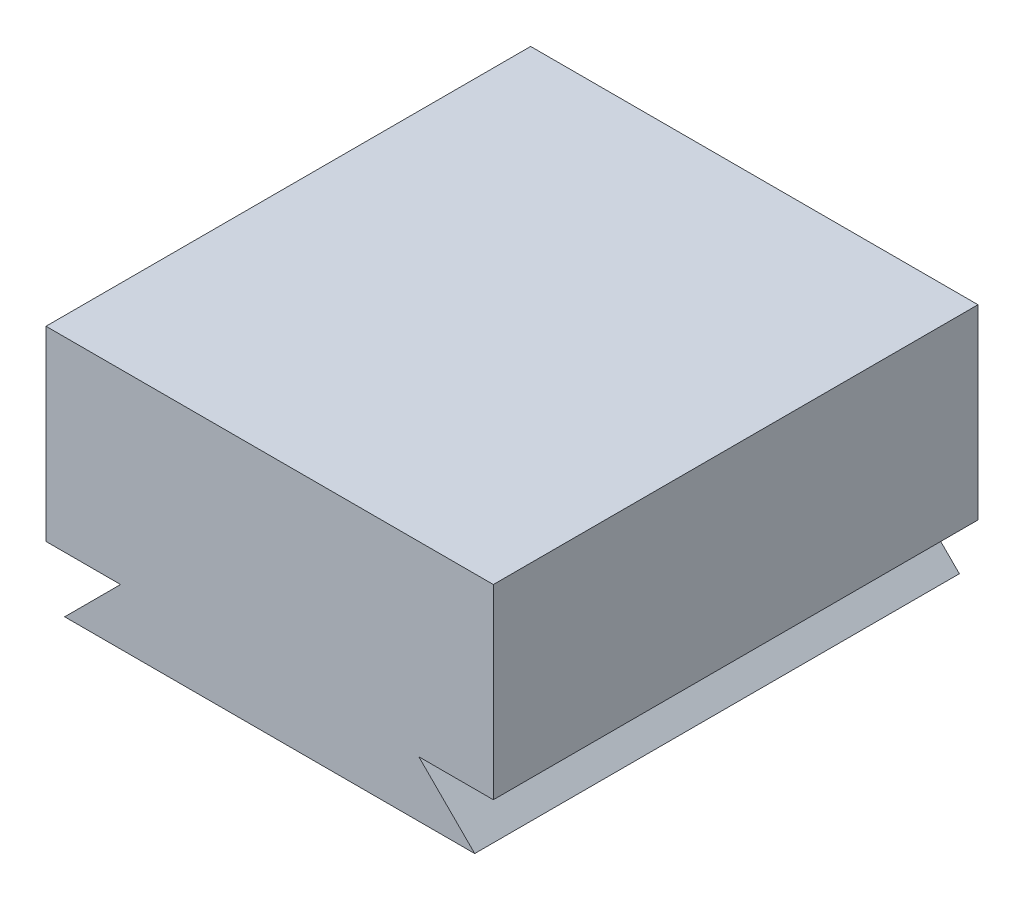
from build123d import *

# Parameters (mm, degrees)
ESQUISSE1_W             = 24
ESQUISSE1_H             = 13
BASE_EXTRUSION_DEPTH    = 26
ENL_V_MAT_EXTRU_1_DEPTH = 38.69615365


with BuildPart() as part:
    # Esquisse1 → Base-Extrusion (new body)
    with BuildSketch(Plane.XY):
        with Locations((12, 6.5)):
            Rectangle(ESQUISSE1_W, ESQUISSE1_H)
    extrude(amount=BASE_EXTRUSION_DEPTH)

    # Esquisse2 → Enl_v. mat.-Extru.1 (cut, through all)
    with BuildSketch(Plane.XY.offset(26)):
        Polygon((0, 0), (1, 0), (4, 3), (0, 3), align=None)
        Polygon((24, 3), (24, 0), (23, 0), (20, 3), align=None)
    extrude(amount=-ENL_V_MAT_EXTRU_1_DEPTH, mode=Mode.SUBTRACT)


solid = part.part
